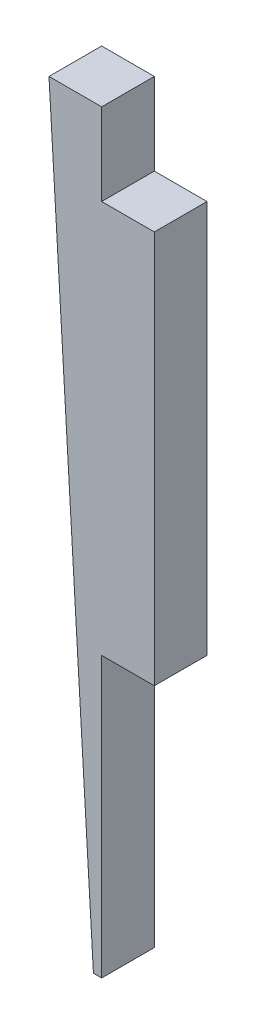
ISO-10303-21;
HEADER;
FILE_DESCRIPTION(('STEP AP214'),'2;1');
FILE_NAME('part.step','',(''),(''),'','','');
FILE_SCHEMA(('AUTOMOTIVE_DESIGN { 1 0 10303 214 1 1 1 1 }'));
ENDSEC;
DATA;
#1=APPLICATION_CONTEXT('core data for automotive mechanical design processes');
#2=APPLICATION_PROTOCOL_DEFINITION('international standard','automotive_design',2000,#1);
#3=PRODUCT_CONTEXT('',#1,'mechanical');
#4=PRODUCT('Part','Part','',(#3));
#5=PRODUCT_RELATED_PRODUCT_CATEGORY('part','',(#4));
#6=PRODUCT_DEFINITION_FORMATION('','',#4);
#7=PRODUCT_DEFINITION_CONTEXT('part definition',#1,'design');
#8=PRODUCT_DEFINITION('design','',#6,#7);
#9=PRODUCT_DEFINITION_SHAPE('','',#8);
#10=(LENGTH_UNIT() NAMED_UNIT(*) SI_UNIT(.MILLI.,.METRE.));
#11=(NAMED_UNIT(*) PLANE_ANGLE_UNIT() SI_UNIT($,.RADIAN.));
#12=(NAMED_UNIT(*) SI_UNIT($,.STERADIAN.) SOLID_ANGLE_UNIT());
#13=UNCERTAINTY_MEASURE_WITH_UNIT(LENGTH_MEASURE(1.E-05),#10,'distance_accuracy_value','');
#14=(GEOMETRIC_REPRESENTATION_CONTEXT(3) GLOBAL_UNCERTAINTY_ASSIGNED_CONTEXT((#13)) GLOBAL_UNIT_ASSIGNED_CONTEXT((#10,
#11,#12)) REPRESENTATION_CONTEXT('',''));
#15=CARTESIAN_POINT('',(0.,0.,0.));
#16=DIRECTION('',(0.,0.,1.));
#17=DIRECTION('',(1.,0.,0.));
#18=AXIS2_PLACEMENT_3D('',#15,#16,#17);
#19=CARTESIAN_POINT('',(-1.524,-3.76945107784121,1.524));
#20=DIRECTION('',(-1.,0.,0.));
#21=DIRECTION('',(0.,0.,1.));
#22=AXIS2_PLACEMENT_3D('',#19,#20,#21);
#23=PLANE('',#22);
#24=DIRECTION('',(0.,1.,0.));
#25=VECTOR('',#24,1.);
#26=CARTESIAN_POINT('',(-1.524,-3.76945107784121,0.));
#27=LINE('',#26,#25);
#28=CARTESIAN_POINT('',(-1.524,-11.8526065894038,0.));
#29=VERTEX_POINT('',#28);
#30=CARTESIAN_POINT('',(-1.524,-3.76945107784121,0.));
#31=VERTEX_POINT('',#30);
#32=EDGE_CURVE('E132',#29,#31,#27,.T.);
#33=ORIENTED_EDGE('',*,*,#32,.T.);
#34=DIRECTION('',(0.,0.,-1.));
#35=VECTOR('',#34,1.);
#36=CARTESIAN_POINT('',(-1.524,-3.76945107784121,1.524));
#37=LINE('',#36,#35);
#38=CARTESIAN_POINT('',(-1.524,-3.76945107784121,1.524));
#39=VERTEX_POINT('',#38);
#40=EDGE_CURVE('E11',#39,#31,#37,.T.);
#41=ORIENTED_EDGE('',*,*,#40,.F.);
#42=DIRECTION('',(0.,1.,0.));
#43=VECTOR('',#42,1.);
#44=CARTESIAN_POINT('',(-1.524,-3.76945107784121,1.524));
#45=LINE('',#44,#43);
#46=CARTESIAN_POINT('',(-1.524,-11.8526065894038,1.524));
#47=VERTEX_POINT('',#46);
#48=EDGE_CURVE('E146',#47,#39,#45,.T.);
#49=ORIENTED_EDGE('',*,*,#48,.F.);
#50=DIRECTION('',(0.,0.,-1.));
#51=VECTOR('',#50,1.);
#52=CARTESIAN_POINT('',(-1.524,-11.8526065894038,1.524));
#53=LINE('',#52,#51);
#54=EDGE_CURVE('E128',#47,#29,#53,.T.);
#55=ORIENTED_EDGE('',*,*,#54,.T.);
#56=EDGE_LOOP('',(#33,#41,#49,#55));
#57=FACE_BOUND('',#56,.T.);
#58=ADVANCED_FACE('F36',(#57),#23,.F.);
#59=CARTESIAN_POINT('',(-1.524,-3.76945107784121,1.524));
#60=DIRECTION('',(0.,1.,0.));
#61=DIRECTION('',(0.,0.,1.));
#62=AXIS2_PLACEMENT_3D('',#59,#60,#61);
#63=PLANE('',#62);
#64=DIRECTION('',(1.,0.,0.));
#65=VECTOR('',#64,1.);
#66=CARTESIAN_POINT('',(-1.524,-3.76945107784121,0.));
#67=LINE('',#66,#65);
#68=CARTESIAN_POINT('',(0.,-3.76945107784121,0.));
#69=VERTEX_POINT('',#68);
#70=EDGE_CURVE('E135',#31,#69,#67,.T.);
#71=ORIENTED_EDGE('',*,*,#70,.T.);
#72=DIRECTION('',(0.,0.,-1.));
#73=VECTOR('',#72,1.);
#74=CARTESIAN_POINT('',(0.,-3.76945107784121,1.524));
#75=LINE('',#74,#73);
#76=CARTESIAN_POINT('',(0.,-3.76945107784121,1.524));
#77=VERTEX_POINT('',#76);
#78=EDGE_CURVE('E44',#77,#69,#75,.T.);
#79=ORIENTED_EDGE('',*,*,#78,.F.);
#80=DIRECTION('',(1.,0.,0.));
#81=VECTOR('',#80,1.);
#82=CARTESIAN_POINT('',(-1.524,-3.76945107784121,1.524));
#83=LINE('',#82,#81);
#84=EDGE_CURVE('E95',#39,#77,#83,.T.);
#85=ORIENTED_EDGE('',*,*,#84,.F.);
#86=ORIENTED_EDGE('',*,*,#40,.T.);
#87=EDGE_LOOP('',(#71,#79,#85,#86));
#88=FACE_BOUND('',#87,.T.);
#89=ADVANCED_FACE('F181',(#88),#63,.F.);
#90=CARTESIAN_POINT('',(0.,-3.76945107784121,1.524));
#91=DIRECTION('',(-1.,0.,0.));
#92=DIRECTION('',(0.,0.,1.));
#93=AXIS2_PLACEMENT_3D('',#90,#91,#92);
#94=PLANE('',#93);
#95=DIRECTION('',(0.,1.,0.));
#96=VECTOR('',#95,1.);
#97=CARTESIAN_POINT('',(0.,-3.76945107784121,0.));
#98=LINE('',#97,#96);
#99=CARTESIAN_POINT('',(0.,7.60094576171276,0.));
#100=VERTEX_POINT('',#99);
#101=EDGE_CURVE('E137',#69,#100,#98,.T.);
#102=ORIENTED_EDGE('',*,*,#101,.T.);
#103=DIRECTION('',(0.,0.,-1.));
#104=VECTOR('',#103,1.);
#105=CARTESIAN_POINT('',(0.,7.60094576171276,1.524));
#106=LINE('',#105,#104);
#107=CARTESIAN_POINT('',(0.,7.60094576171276,1.524));
#108=VERTEX_POINT('',#107);
#109=EDGE_CURVE('E153',#108,#100,#106,.T.);
#110=ORIENTED_EDGE('',*,*,#109,.F.);
#111=DIRECTION('',(0.,1.,0.));
#112=VECTOR('',#111,1.);
#113=CARTESIAN_POINT('',(0.,-3.76945107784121,1.524));
#114=LINE('',#113,#112);
#115=EDGE_CURVE('E161',#77,#108,#114,.T.);
#116=ORIENTED_EDGE('',*,*,#115,.F.);
#117=ORIENTED_EDGE('',*,*,#78,.T.);
#118=EDGE_LOOP('',(#102,#110,#116,#117));
#119=FACE_BOUND('',#118,.T.);
#120=ADVANCED_FACE('F159',(#119),#94,.F.);
#121=CARTESIAN_POINT('',(0.,7.60094576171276,1.524));
#122=DIRECTION('',(0.,-1.,0.));
#123=DIRECTION('',(0.,0.,-1.));
#124=AXIS2_PLACEMENT_3D('',#121,#122,#123);
#125=PLANE('',#124);
#126=DIRECTION('',(-1.,0.,0.));
#127=VECTOR('',#126,1.);
#128=CARTESIAN_POINT('',(0.,7.60094576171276,0.));
#129=LINE('',#128,#127);
#130=CARTESIAN_POINT('',(-1.524,7.60094576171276,0.));
#131=VERTEX_POINT('',#130);
#132=EDGE_CURVE('E139',#100,#131,#129,.T.);
#133=ORIENTED_EDGE('',*,*,#132,.T.);
#134=DIRECTION('',(0.,0.,-1.));
#135=VECTOR('',#134,1.);
#136=CARTESIAN_POINT('',(-1.524,7.60094576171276,1.524));
#137=LINE('',#136,#135);
#138=CARTESIAN_POINT('',(-1.524,7.60094576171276,1.524));
#139=VERTEX_POINT('',#138);
#140=EDGE_CURVE('E150',#139,#131,#137,.T.);
#141=ORIENTED_EDGE('',*,*,#140,.F.);
#142=DIRECTION('',(-1.,0.,0.));
#143=VECTOR('',#142,1.);
#144=CARTESIAN_POINT('',(0.,7.60094576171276,1.524));
#145=LINE('',#144,#143);
#146=EDGE_CURVE('E173',#108,#139,#145,.T.);
#147=ORIENTED_EDGE('',*,*,#146,.F.);
#148=ORIENTED_EDGE('',*,*,#109,.T.);
#149=EDGE_LOOP('',(#133,#141,#147,#148));
#150=FACE_BOUND('',#149,.T.);
#151=ADVANCED_FACE('F169',(#150),#125,.F.);
#152=CARTESIAN_POINT('',(-1.524,7.60094576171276,1.524));
#153=DIRECTION('',(-1.,0.,0.));
#154=DIRECTION('',(0.,0.,1.));
#155=AXIS2_PLACEMENT_3D('',#152,#153,#154);
#156=PLANE('',#155);
#157=DIRECTION('',(0.,1.,0.));
#158=VECTOR('',#157,1.);
#159=CARTESIAN_POINT('',(-1.524,7.60094576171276,0.));
#160=LINE('',#159,#158);
#161=CARTESIAN_POINT('',(-1.524,9.97310818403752,0.));
#162=VERTEX_POINT('',#161);
#163=EDGE_CURVE('E141',#131,#162,#160,.T.);
#164=ORIENTED_EDGE('',*,*,#163,.T.);
#165=DIRECTION('',(0.,0.,-1.));
#166=VECTOR('',#165,1.);
#167=CARTESIAN_POINT('',(-1.524,9.97310818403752,1.524));
#168=LINE('',#167,#166);
#169=CARTESIAN_POINT('',(-1.524,9.97310818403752,1.524));
#170=VERTEX_POINT('',#169);
#171=EDGE_CURVE('E123',#170,#162,#168,.T.);
#172=ORIENTED_EDGE('',*,*,#171,.F.);
#173=DIRECTION('',(0.,1.,0.));
#174=VECTOR('',#173,1.);
#175=CARTESIAN_POINT('',(-1.524,7.60094576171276,1.524));
#176=LINE('',#175,#174);
#177=EDGE_CURVE('E114',#139,#170,#176,.T.);
#178=ORIENTED_EDGE('',*,*,#177,.F.);
#179=ORIENTED_EDGE('',*,*,#140,.T.);
#180=EDGE_LOOP('',(#164,#172,#178,#179));
#181=FACE_BOUND('',#180,.T.);
#182=ADVANCED_FACE('F172',(#181),#156,.F.);
#183=CARTESIAN_POINT('',(-1.524,9.97310818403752,1.524));
#184=DIRECTION('',(0.,-1.,0.));
#185=DIRECTION('',(0.,0.,-1.));
#186=AXIS2_PLACEMENT_3D('',#183,#184,#185);
#187=PLANE('',#186);
#188=DIRECTION('',(-1.,0.,0.));
#189=VECTOR('',#188,1.);
#190=CARTESIAN_POINT('',(-1.524,9.97310818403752,0.));
#191=LINE('',#190,#189);
#192=CARTESIAN_POINT('',(-3.048,9.97310818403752,0.));
#193=VERTEX_POINT('',#192);
#194=EDGE_CURVE('E122',#162,#193,#191,.T.);
#195=ORIENTED_EDGE('',*,*,#194,.T.);
#196=DIRECTION('',(0.,0.,-1.));
#197=VECTOR('',#196,1.);
#198=CARTESIAN_POINT('',(-3.048,9.97310818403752,1.524));
#199=LINE('',#198,#197);
#200=CARTESIAN_POINT('',(-3.048,9.97310818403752,1.524));
#201=VERTEX_POINT('',#200);
#202=EDGE_CURVE('E119',#201,#193,#199,.T.);
#203=ORIENTED_EDGE('',*,*,#202,.F.);
#204=DIRECTION('',(-1.,0.,0.));
#205=VECTOR('',#204,1.);
#206=CARTESIAN_POINT('',(-1.524,9.97310818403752,1.524));
#207=LINE('',#206,#205);
#208=EDGE_CURVE('E108',#170,#201,#207,.T.);
#209=ORIENTED_EDGE('',*,*,#208,.F.);
#210=ORIENTED_EDGE('',*,*,#171,.T.);
#211=EDGE_LOOP('',(#195,#203,#209,#210));
#212=FACE_BOUND('',#211,.T.);
#213=ADVANCED_FACE('F120',(#212),#187,.F.);
#214=CARTESIAN_POINT('',(-3.048,9.97310818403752,1.524));
#215=DIRECTION('',(0.998268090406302,0.058828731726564,0.));
#216=DIRECTION('',(-0.058828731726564,0.998268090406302,0.));
#217=AXIS2_PLACEMENT_3D('',#214,#215,#216);
#218=PLANE('',#217);
#219=DIRECTION('',(0.058828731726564,-0.998268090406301,0.));
#220=VECTOR('',#219,1.);
#221=CARTESIAN_POINT('',(-3.048,9.97310818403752,0.));
#222=LINE('',#221,#220);
#223=CARTESIAN_POINT('',(-1.76179328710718,-11.8526065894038,0.));
#224=VERTEX_POINT('',#223);
#225=EDGE_CURVE('E81',#193,#224,#222,.T.);
#226=ORIENTED_EDGE('',*,*,#225,.T.);
#227=DIRECTION('',(0.,0.,-1.));
#228=VECTOR('',#227,1.);
#229=CARTESIAN_POINT('',(-1.76179328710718,-11.8526065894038,1.524));
#230=LINE('',#229,#228);
#231=CARTESIAN_POINT('',(-1.76179328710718,-11.8526065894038,1.524));
#232=VERTEX_POINT('',#231);
#233=EDGE_CURVE('E124',#232,#224,#230,.T.);
#234=ORIENTED_EDGE('',*,*,#233,.F.);
#235=DIRECTION('',(0.058828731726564,-0.998268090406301,0.));
#236=VECTOR('',#235,1.);
#237=CARTESIAN_POINT('',(-3.048,9.97310818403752,1.524));
#238=LINE('',#237,#236);
#239=EDGE_CURVE('E112',#201,#232,#238,.T.);
#240=ORIENTED_EDGE('',*,*,#239,.F.);
#241=ORIENTED_EDGE('',*,*,#202,.T.);
#242=EDGE_LOOP('',(#226,#234,#240,#241));
#243=FACE_BOUND('',#242,.T.);
#244=ADVANCED_FACE('F126',(#243),#218,.F.);
#245=CARTESIAN_POINT('',(-1.524,-11.8526065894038,1.524));
#246=DIRECTION('',(0.,1.,0.));
#247=DIRECTION('',(-1.,0.,0.));
#248=AXIS2_PLACEMENT_3D('',#245,#246,#247);
#249=PLANE('',#248);
#250=DIRECTION('',(1.,0.,0.));
#251=VECTOR('',#250,1.);
#252=CARTESIAN_POINT('',(-1.524,-11.8526065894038,0.));
#253=LINE('',#252,#251);
#254=EDGE_CURVE('E87',#224,#29,#253,.T.);
#255=ORIENTED_EDGE('',*,*,#254,.T.);
#256=ORIENTED_EDGE('',*,*,#54,.F.);
#257=DIRECTION('',(1.,0.,0.));
#258=VECTOR('',#257,1.);
#259=CARTESIAN_POINT('',(-1.524,-11.8526065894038,1.524));
#260=LINE('',#259,#258);
#261=EDGE_CURVE('E52',#232,#47,#260,.T.);
#262=ORIENTED_EDGE('',*,*,#261,.F.);
#263=ORIENTED_EDGE('',*,*,#233,.T.);
#264=EDGE_LOOP('',(#255,#256,#262,#263));
#265=FACE_BOUND('',#264,.T.);
#266=ADVANCED_FACE('F197',(#265),#249,.F.);
#267=CARTESIAN_POINT('',(0.,0.,1.524));
#268=DIRECTION('',(0.,0.,-1.));
#269=DIRECTION('',(-1.,0.,0.));
#270=AXIS2_PLACEMENT_3D('',#267,#268,#269);
#271=PLANE('',#270);
#272=ORIENTED_EDGE('',*,*,#48,.T.);
#273=ORIENTED_EDGE('',*,*,#84,.T.);
#274=ORIENTED_EDGE('',*,*,#115,.T.);
#275=ORIENTED_EDGE('',*,*,#146,.T.);
#276=ORIENTED_EDGE('',*,*,#177,.T.);
#277=ORIENTED_EDGE('',*,*,#208,.T.);
#278=ORIENTED_EDGE('',*,*,#239,.T.);
#279=ORIENTED_EDGE('',*,*,#261,.T.);
#280=EDGE_LOOP('',(#272,#273,#274,#275,#276,#277,#278,#279));
#281=FACE_BOUND('',#280,.T.);
#282=ADVANCED_FACE('F110',(#281),#271,.F.);
#283=CARTESIAN_POINT('',(0.,0.,0.));
#284=DIRECTION('',(0.,0.,-1.));
#285=DIRECTION('',(-1.,0.,0.));
#286=AXIS2_PLACEMENT_3D('',#283,#284,#285);
#287=PLANE('',#286);
#288=ORIENTED_EDGE('',*,*,#32,.F.);
#289=ORIENTED_EDGE('',*,*,#254,.F.);
#290=ORIENTED_EDGE('',*,*,#225,.F.);
#291=ORIENTED_EDGE('',*,*,#194,.F.);
#292=ORIENTED_EDGE('',*,*,#163,.F.);
#293=ORIENTED_EDGE('',*,*,#132,.F.);
#294=ORIENTED_EDGE('',*,*,#101,.F.);
#295=ORIENTED_EDGE('',*,*,#70,.F.);
#296=EDGE_LOOP('',(#288,#289,#290,#291,#292,#293,#294,#295));
#297=FACE_BOUND('',#296,.T.);
#298=ADVANCED_FACE('F165',(#297),#287,.T.);
#299=CLOSED_SHELL('',(#58,#89,#120,#151,#182,#213,#244,#266,#282,#298));
#300=MANIFOLD_SOLID_BREP('B2',#299);
#301=ADVANCED_BREP_SHAPE_REPRESENTATION('',(#18,#300),#14);
#302=SHAPE_DEFINITION_REPRESENTATION(#9,#301);
ENDSEC;
END-ISO-10303-21;
